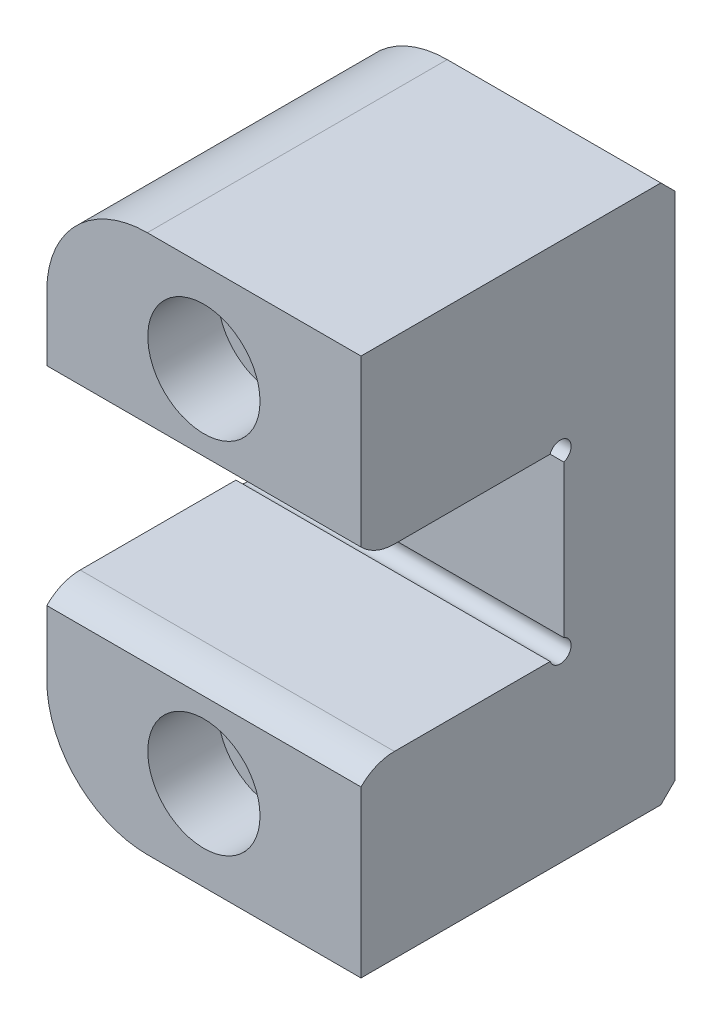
ISO-10303-21;
HEADER;
FILE_DESCRIPTION(('STEP AP214'),'2;1');
FILE_NAME('part.step','',(''),(''),'','','');
FILE_SCHEMA(('AUTOMOTIVE_DESIGN { 1 0 10303 214 1 1 1 1 }'));
ENDSEC;
DATA;
#1=APPLICATION_CONTEXT('core data for automotive mechanical design processes');
#2=APPLICATION_PROTOCOL_DEFINITION('international standard','automotive_design',2000,#1);
#3=PRODUCT_CONTEXT('',#1,'mechanical');
#4=PRODUCT('Part','Part','',(#3));
#5=PRODUCT_RELATED_PRODUCT_CATEGORY('part','',(#4));
#6=PRODUCT_DEFINITION_FORMATION('','',#4);
#7=PRODUCT_DEFINITION_CONTEXT('part definition',#1,'design');
#8=PRODUCT_DEFINITION('design','',#6,#7);
#9=PRODUCT_DEFINITION_SHAPE('','',#8);
#10=(LENGTH_UNIT() NAMED_UNIT(*) SI_UNIT(.MILLI.,.METRE.));
#11=(NAMED_UNIT(*) PLANE_ANGLE_UNIT() SI_UNIT($,.RADIAN.));
#12=(NAMED_UNIT(*) SI_UNIT($,.STERADIAN.) SOLID_ANGLE_UNIT());
#13=UNCERTAINTY_MEASURE_WITH_UNIT(LENGTH_MEASURE(1.E-05),#10,'distance_accuracy_value','');
#14=(GEOMETRIC_REPRESENTATION_CONTEXT(3) GLOBAL_UNCERTAINTY_ASSIGNED_CONTEXT((#13)) GLOBAL_UNIT_ASSIGNED_CONTEXT((#10,
#11,#12)) REPRESENTATION_CONTEXT('',''));
#15=CARTESIAN_POINT('',(0.,0.,0.));
#16=DIRECTION('',(0.,0.,1.));
#17=DIRECTION('',(1.,0.,0.));
#18=AXIS2_PLACEMENT_3D('',#15,#16,#17);
#19=CARTESIAN_POINT('',(11.1125,6.35,-14.351));
#20=DIRECTION('',(0.,0.,-1.));
#21=DIRECTION('',(-1.,0.,0.));
#22=AXIS2_PLACEMENT_3D('',#19,#20,#21);
#23=PLANE('',#22);
#24=DIRECTION('',(-0.866025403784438,0.500000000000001,0.));
#25=VECTOR('',#24,1.);
#26=CARTESIAN_POINT('',(4.86884233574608,-4.46433229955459,-14.351));
#27=LINE('',#26,#25);
#28=CARTESIAN_POINT('',(-8.50411357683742,3.25654739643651,-14.351));
#29=VERTEX_POINT('',#28);
#30=CARTESIAN_POINT('',(-11.1125,4.7625,-14.351));
#31=VERTEX_POINT('',#30);
#32=EDGE_CURVE('E340',#29,#31,#27,.T.);
#33=ORIENTED_EDGE('',*,*,#32,.F.);
#34=DIRECTION('',(0.,-1.,0.));
#35=VECTOR('',#34,1.);
#36=CARTESIAN_POINT('',(-8.50411357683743,-3.84595644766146,-14.351));
#37=LINE('',#36,#35);
#38=CARTESIAN_POINT('',(-8.50411357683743,-3.25654739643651,-14.351));
#39=VERTEX_POINT('',#38);
#40=EDGE_CURVE('E255',#29,#39,#37,.T.);
#41=ORIENTED_EDGE('',*,*,#40,.T.);
#42=DIRECTION('',(0.866025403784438,0.500000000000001,0.));
#43=VECTOR('',#42,1.);
#44=CARTESIAN_POINT('',(10.3681036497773,7.63933229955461,-14.351));
#45=LINE('',#44,#43);
#46=CARTESIAN_POINT('',(-11.1125,-4.76249999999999,-14.351));
#47=VERTEX_POINT('',#46);
#48=EDGE_CURVE('E338',#47,#39,#45,.T.);
#49=ORIENTED_EDGE('',*,*,#48,.F.);
#50=DIRECTION('',(0.,-1.,0.));
#51=VECTOR('',#50,1.);
#52=CARTESIAN_POINT('',(-11.1125,6.35,-14.351));
#53=LINE('',#52,#51);
#54=CARTESIAN_POINT('',(-11.1125,-5.37757951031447,-14.351));
#55=VERTEX_POINT('',#54);
#56=EDGE_CURVE('E221',#47,#55,#53,.T.);
#57=ORIENTED_EDGE('',*,*,#56,.T.);
#58=DIRECTION('',(1.,0.,0.));
#59=VECTOR('',#58,1.);
#60=CARTESIAN_POINT('',(-11.1125,-5.37757951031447,-14.351));
#61=LINE('',#60,#59);
#62=CARTESIAN_POINT('',(11.1125,-5.37757951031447,-14.351));
#63=VERTEX_POINT('',#62);
#64=EDGE_CURVE('E194',#55,#63,#61,.T.);
#65=ORIENTED_EDGE('',*,*,#64,.T.);
#66=DIRECTION('',(0.,-1.,0.));
#67=VECTOR('',#66,1.);
#68=CARTESIAN_POINT('',(11.1125,6.35,-14.351));
#69=LINE('',#68,#67);
#70=CARTESIAN_POINT('',(11.1125,5.37757951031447,-14.351));
#71=VERTEX_POINT('',#70);
#72=EDGE_CURVE('E348',#71,#63,#69,.T.);
#73=ORIENTED_EDGE('',*,*,#72,.F.);
#74=DIRECTION('',(1.,0.,0.));
#75=VECTOR('',#74,1.);
#76=CARTESIAN_POINT('',(-11.1125,5.37757951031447,-14.351));
#77=LINE('',#76,#75);
#78=CARTESIAN_POINT('',(-11.1125,5.37757951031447,-14.351));
#79=VERTEX_POINT('',#78);
#80=EDGE_CURVE('E416',#71,#79,#77,.F.);
#81=ORIENTED_EDGE('',*,*,#80,.T.);
#82=EDGE_CURVE('E215',#79,#31,#53,.T.);
#83=ORIENTED_EDGE('',*,*,#82,.T.);
#84=EDGE_LOOP('',(#33,#41,#49,#57,#65,#73,#81,#83));
#85=FACE_BOUND('',#84,.T.);
#86=ADVANCED_FACE('F32',(#85),#23,.F.);
#87=CARTESIAN_POINT('',(11.1125,19.05,-22.225));
#88=DIRECTION('',(0.,0.,1.));
#89=DIRECTION('',(1.,0.,0.));
#90=AXIS2_PLACEMENT_3D('',#87,#88,#89);
#91=PLANE('',#90);
#92=CARTESIAN_POINT('',(0.,12.7,-22.225));
#93=DIRECTION('',(0.,0.,1.));
#94=DIRECTION('',(1.,0.,0.));
#95=AXIS2_PLACEMENT_3D('',#92,#93,#94);
#96=CIRCLE('',#95,2.45744999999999);
#97=CARTESIAN_POINT('',(2.45744999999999,12.7,-22.225));
#98=VERTEX_POINT('',#97);
#99=EDGE_CURVE('E720',#98,#98,#96,.T.);
#100=ORIENTED_EDGE('',*,*,#99,.T.);
#101=EDGE_LOOP('',(#100));
#102=FACE_BOUND('',#101,.T.);
#103=CARTESIAN_POINT('',(0.,-12.7,-22.225));
#104=DIRECTION('',(0.,0.,1.));
#105=DIRECTION('',(1.,0.,0.));
#106=AXIS2_PLACEMENT_3D('',#103,#104,#105);
#107=CIRCLE('',#106,2.45744999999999);
#108=CARTESIAN_POINT('',(2.45744999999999,-12.7,-22.225));
#109=VERTEX_POINT('',#108);
#110=EDGE_CURVE('E706',#109,#109,#107,.T.);
#111=ORIENTED_EDGE('',*,*,#110,.T.);
#112=EDGE_LOOP('',(#111));
#113=FACE_BOUND('',#112,.T.);
#114=CARTESIAN_POINT('',(-4.0005,-11.938,-22.225));
#115=DIRECTION('',(0.,0.,1.));
#116=DIRECTION('',(1.,0.,0.));
#117=AXIS2_PLACEMENT_3D('',#114,#115,#116);
#118=CIRCLE('',#117,6.09600000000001);
#119=CARTESIAN_POINT('',(-4.0005,-18.034,-22.225));
#120=VERTEX_POINT('',#119);
#121=CARTESIAN_POINT('',(-10.0965,-11.938,-22.225));
#122=VERTEX_POINT('',#121);
#123=EDGE_CURVE('E271',#120,#122,#118,.F.);
#124=ORIENTED_EDGE('',*,*,#123,.T.);
#125=DIRECTION('',(0.,1.,0.));
#126=VECTOR('',#125,1.);
#127=CARTESIAN_POINT('',(-10.0965,-4.76249999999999,-22.225));
#128=LINE('',#127,#126);
#129=CARTESIAN_POINT('',(-10.0965,-4.17591212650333,-22.225));
#130=VERTEX_POINT('',#129);
#131=EDGE_CURVE('E273',#122,#130,#128,.T.);
#132=ORIENTED_EDGE('',*,*,#131,.T.);
#133=DIRECTION('',(0.866025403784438,0.500000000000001,0.));
#134=VECTOR('',#133,1.);
#135=CARTESIAN_POINT('',(-9.525,-3.84595644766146,-22.225));
#136=LINE('',#135,#134);
#137=CARTESIAN_POINT('',(-9.525,-3.84595644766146,-22.225));
#138=VERTEX_POINT('',#137);
#139=EDGE_CURVE('E324',#130,#138,#136,.T.);
#140=ORIENTED_EDGE('',*,*,#139,.T.);
#141=DIRECTION('',(0.,1.,0.));
#142=VECTOR('',#141,1.);
#143=CARTESIAN_POINT('',(-9.525,3.84595644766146,-22.225));
#144=LINE('',#143,#142);
#145=CARTESIAN_POINT('',(-9.525,3.84595644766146,-22.225));
#146=VERTEX_POINT('',#145);
#147=EDGE_CURVE('E323',#138,#146,#144,.T.);
#148=ORIENTED_EDGE('',*,*,#147,.T.);
#149=DIRECTION('',(-0.866025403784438,0.500000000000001,0.));
#150=VECTOR('',#149,1.);
#151=CARTESIAN_POINT('',(-9.525,3.84595644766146,-22.225));
#152=LINE('',#151,#150);
#153=CARTESIAN_POINT('',(-10.0965,4.17591212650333,-22.225));
#154=VERTEX_POINT('',#153);
#155=EDGE_CURVE('E317',#146,#154,#152,.T.);
#156=ORIENTED_EDGE('',*,*,#155,.T.);
#157=DIRECTION('',(0.,1.,0.));
#158=VECTOR('',#157,1.);
#159=CARTESIAN_POINT('',(-10.0965,11.938,-22.225));
#160=LINE('',#159,#158);
#161=CARTESIAN_POINT('',(-10.0965,11.938,-22.225));
#162=VERTEX_POINT('',#161);
#163=EDGE_CURVE('E265',#154,#162,#160,.T.);
#164=ORIENTED_EDGE('',*,*,#163,.T.);
#165=CARTESIAN_POINT('',(-4.0005,11.938,-22.225));
#166=DIRECTION('',(0.,0.,1.));
#167=DIRECTION('',(1.,0.,0.));
#168=AXIS2_PLACEMENT_3D('',#165,#166,#167);
#169=CIRCLE('',#168,6.09599999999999);
#170=CARTESIAN_POINT('',(-4.0005,18.034,-22.225));
#171=VERTEX_POINT('',#170);
#172=EDGE_CURVE('E263',#162,#171,#169,.F.);
#173=ORIENTED_EDGE('',*,*,#172,.T.);
#174=DIRECTION('',(1.,0.,0.));
#175=VECTOR('',#174,1.);
#176=CARTESIAN_POINT('',(11.1125,18.034,-22.225));
#177=LINE('',#176,#175);
#178=CARTESIAN_POINT('',(11.1125,18.034,-22.225));
#179=VERTEX_POINT('',#178);
#180=EDGE_CURVE('E267',#171,#179,#177,.T.);
#181=ORIENTED_EDGE('',*,*,#180,.T.);
#182=DIRECTION('',(0.,1.,0.));
#183=VECTOR('',#182,1.);
#184=CARTESIAN_POINT('',(11.1125,19.05,-22.225));
#185=LINE('',#184,#183);
#186=CARTESIAN_POINT('',(11.1125,-18.034,-22.225));
#187=VERTEX_POINT('',#186);
#188=EDGE_CURVE('E357',#187,#179,#185,.T.);
#189=ORIENTED_EDGE('',*,*,#188,.F.);
#190=DIRECTION('',(-1.,0.,0.));
#191=VECTOR('',#190,1.);
#192=CARTESIAN_POINT('',(11.1125,-18.034,-22.225));
#193=LINE('',#192,#191);
#194=EDGE_CURVE('E269',#187,#120,#193,.T.);
#195=ORIENTED_EDGE('',*,*,#194,.T.);
#196=EDGE_LOOP('',(#124,#132,#140,#148,#156,#164,#173,#181,#189,#195));
#197=FACE_BOUND('',#196,.T.);
#198=ADVANCED_FACE('F321',(#102,#113,#197),#91,.F.);
#199=CARTESIAN_POINT('',(-11.1125,-6.35,0.));
#200=DIRECTION('',(-1.,0.,0.));
#201=DIRECTION('',(0.,0.,1.));
#202=AXIS2_PLACEMENT_3D('',#199,#200,#201);
#203=PLANE('',#202);
#204=DIRECTION('',(0.,0.,1.));
#205=VECTOR('',#204,1.);
#206=CARTESIAN_POINT('',(-11.1125,11.938,-22.225));
#207=LINE('',#206,#205);
#208=CARTESIAN_POINT('',(-11.1125,11.938,0.));
#209=VERTEX_POINT('',#208);
#210=CARTESIAN_POINT('',(-11.1125,11.938,-21.209));
#211=VERTEX_POINT('',#210);
#212=EDGE_CURVE('E235',#209,#211,#207,.F.);
#213=ORIENTED_EDGE('',*,*,#212,.T.);
#214=DIRECTION('',(0.,-1.,0.));
#215=VECTOR('',#214,1.);
#216=CARTESIAN_POINT('',(-11.1125,4.7625,-21.209));
#217=LINE('',#216,#215);
#218=CARTESIAN_POINT('',(-11.1125,4.76249999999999,-21.209));
#219=VERTEX_POINT('',#218);
#220=EDGE_CURVE('E49',#211,#219,#217,.T.);
#221=ORIENTED_EDGE('',*,*,#220,.T.);
#222=DIRECTION('',(0.,0.,1.));
#223=VECTOR('',#222,1.);
#224=CARTESIAN_POINT('',(-11.1125,4.7625,0.));
#225=LINE('',#224,#223);
#226=EDGE_CURVE('E247',#219,#31,#225,.T.);
#227=ORIENTED_EDGE('',*,*,#226,.T.);
#228=ORIENTED_EDGE('',*,*,#82,.F.);
#229=CARTESIAN_POINT('',(-11.1125,6.096,-14.097));
#230=DIRECTION('',(1.,0.,0.));
#231=DIRECTION('',(0.,0.,-1.));
#232=AXIS2_PLACEMENT_3D('',#229,#230,#231);
#233=CIRCLE('',#232,0.762000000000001);
#234=CARTESIAN_POINT('',(-11.1125,6.35,-13.3785795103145));
#235=VERTEX_POINT('',#234);
#236=EDGE_CURVE('E423',#79,#235,#233,.T.);
#237=ORIENTED_EDGE('',*,*,#236,.T.);
#238=DIRECTION('',(0.,0.,-1.));
#239=VECTOR('',#238,1.);
#240=CARTESIAN_POINT('',(-11.1125,6.35,0.));
#241=LINE('',#240,#239);
#242=CARTESIAN_POINT('',(-11.1125,6.35,-2.36219999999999));
#243=VERTEX_POINT('',#242);
#244=EDGE_CURVE('E362',#243,#235,#241,.T.);
#245=ORIENTED_EDGE('',*,*,#244,.F.);
#246=CARTESIAN_POINT('',(-11.1125,9.64915342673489,-2.36219999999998));
#247=DIRECTION('',(-1.,0.,0.));
#248=DIRECTION('',(0.,0.,-1.));
#249=AXIS2_PLACEMENT_3D('',#246,#247,#248);
#250=CIRCLE('',#249,3.29915342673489);
#251=CARTESIAN_POINT('',(-11.1125,7.3460198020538,0.));
#252=VERTEX_POINT('',#251);
#253=EDGE_CURVE('E415',#243,#252,#250,.T.);
#254=ORIENTED_EDGE('',*,*,#253,.T.);
#255=DIRECTION('',(0.,-1.,0.));
#256=VECTOR('',#255,1.);
#257=CARTESIAN_POINT('',(-11.1125,19.05,0.));
#258=LINE('',#257,#256);
#259=EDGE_CURVE('E342',#209,#252,#258,.T.);
#260=ORIENTED_EDGE('',*,*,#259,.F.);
#261=EDGE_LOOP('',(#213,#221,#227,#228,#237,#245,#254,#260));
#262=FACE_BOUND('',#261,.T.);
#263=ADVANCED_FACE('F459',(#262),#203,.T.);
#264=DIRECTION('',(0.,0.,-1.));
#265=VECTOR('',#264,1.);
#266=CARTESIAN_POINT('',(-11.1125,-4.76249999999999,0.));
#267=LINE('',#266,#265);
#268=CARTESIAN_POINT('',(-11.1125,-4.76249999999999,-21.209));
#269=VERTEX_POINT('',#268);
#270=EDGE_CURVE('E245',#47,#269,#267,.T.);
#271=ORIENTED_EDGE('',*,*,#270,.T.);
#272=DIRECTION('',(0.,-1.,0.));
#273=VECTOR('',#272,1.);
#274=CARTESIAN_POINT('',(-11.1125,-11.938,-21.209));
#275=LINE('',#274,#273);
#276=CARTESIAN_POINT('',(-11.1125,-11.938,-21.209));
#277=VERTEX_POINT('',#276);
#278=EDGE_CURVE('E278',#269,#277,#275,.T.);
#279=ORIENTED_EDGE('',*,*,#278,.T.);
#280=DIRECTION('',(0.,0.,-1.));
#281=VECTOR('',#280,1.);
#282=CARTESIAN_POINT('',(-11.1125,-11.938,0.));
#283=LINE('',#282,#281);
#284=CARTESIAN_POINT('',(-11.1125,-11.938,0.));
#285=VERTEX_POINT('',#284);
#286=EDGE_CURVE('E237',#277,#285,#283,.F.);
#287=ORIENTED_EDGE('',*,*,#286,.T.);
#288=DIRECTION('',(0.,-1.,0.));
#289=VECTOR('',#288,1.);
#290=CARTESIAN_POINT('',(-11.1125,-6.35,0.));
#291=LINE('',#290,#289);
#292=CARTESIAN_POINT('',(-11.1125,-7.3460198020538,0.));
#293=VERTEX_POINT('',#292);
#294=EDGE_CURVE('E214',#293,#285,#291,.T.);
#295=ORIENTED_EDGE('',*,*,#294,.F.);
#296=CARTESIAN_POINT('',(-11.1125,-9.64915342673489,-2.36219999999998));
#297=DIRECTION('',(-1.,0.,0.));
#298=DIRECTION('',(0.,0.,1.));
#299=AXIS2_PLACEMENT_3D('',#296,#297,#298);
#300=CIRCLE('',#299,3.29915342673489);
#301=CARTESIAN_POINT('',(-11.1125,-6.35,-2.36219999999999));
#302=VERTEX_POINT('',#301);
#303=EDGE_CURVE('E213',#293,#302,#300,.T.);
#304=ORIENTED_EDGE('',*,*,#303,.T.);
#305=DIRECTION('',(0.,0.,1.));
#306=VECTOR('',#305,1.);
#307=CARTESIAN_POINT('',(-11.1125,-6.35,-14.351));
#308=LINE('',#307,#306);
#309=CARTESIAN_POINT('',(-11.1125,-6.35,-13.3785795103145));
#310=VERTEX_POINT('',#309);
#311=EDGE_CURVE('E205',#310,#302,#308,.T.);
#312=ORIENTED_EDGE('',*,*,#311,.F.);
#313=CARTESIAN_POINT('',(-11.1125,-6.096,-14.097));
#314=DIRECTION('',(1.,0.,0.));
#315=DIRECTION('',(0.,0.,1.));
#316=AXIS2_PLACEMENT_3D('',#313,#314,#315);
#317=CIRCLE('',#316,0.762000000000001);
#318=EDGE_CURVE('E188',#310,#55,#317,.T.);
#319=ORIENTED_EDGE('',*,*,#318,.T.);
#320=ORIENTED_EDGE('',*,*,#56,.F.);
#321=EDGE_LOOP('',(#271,#279,#287,#295,#304,#312,#319,#320));
#322=FACE_BOUND('',#321,.T.);
#323=ADVANCED_FACE('F211',(#322),#203,.T.);
#324=CARTESIAN_POINT('',(11.1125,19.05,0.));
#325=DIRECTION('',(0.,0.,-1.));
#326=DIRECTION('',(0.,1.,0.));
#327=AXIS2_PLACEMENT_3D('',#324,#325,#326);
#328=PLANE('',#327);
#329=CARTESIAN_POINT('',(0.,12.7,0.));
#330=DIRECTION('',(0.,0.,1.));
#331=DIRECTION('',(1.,0.,0.));
#332=AXIS2_PLACEMENT_3D('',#329,#330,#331);
#333=CIRCLE('',#332,3.96875);
#334=CARTESIAN_POINT('',(3.96875,12.7,0.));
#335=VERTEX_POINT('',#334);
#336=EDGE_CURVE('E298',#335,#335,#333,.T.);
#337=ORIENTED_EDGE('',*,*,#336,.F.);
#338=EDGE_LOOP('',(#337));
#339=FACE_BOUND('',#338,.T.);
#340=ORIENTED_EDGE('',*,*,#259,.T.);
#341=DIRECTION('',(1.,0.,0.));
#342=VECTOR('',#341,1.);
#343=CARTESIAN_POINT('',(-11.1125,7.3460198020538,0.));
#344=LINE('',#343,#342);
#345=CARTESIAN_POINT('',(11.1125,7.3460198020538,0.));
#346=VERTEX_POINT('',#345);
#347=EDGE_CURVE('E410',#252,#346,#344,.T.);
#348=ORIENTED_EDGE('',*,*,#347,.T.);
#349=DIRECTION('',(0.,-1.,0.));
#350=VECTOR('',#349,1.);
#351=CARTESIAN_POINT('',(11.1125,19.05,0.));
#352=LINE('',#351,#350);
#353=CARTESIAN_POINT('',(11.1125,19.05,0.));
#354=VERTEX_POINT('',#353);
#355=EDGE_CURVE('E218',#354,#346,#352,.T.);
#356=ORIENTED_EDGE('',*,*,#355,.F.);
#357=DIRECTION('',(-1.,0.,0.));
#358=VECTOR('',#357,1.);
#359=CARTESIAN_POINT('',(11.1125,19.05,0.));
#360=LINE('',#359,#358);
#361=CARTESIAN_POINT('',(-4.0005,19.05,0.));
#362=VERTEX_POINT('',#361);
#363=EDGE_CURVE('E225',#354,#362,#360,.T.);
#364=ORIENTED_EDGE('',*,*,#363,.T.);
#365=CARTESIAN_POINT('',(-4.0005,11.938,0.));
#366=DIRECTION('',(0.,0.,-1.));
#367=DIRECTION('',(0.,1.,0.));
#368=AXIS2_PLACEMENT_3D('',#365,#366,#367);
#369=CIRCLE('',#368,7.112);
#370=EDGE_CURVE('E243',#362,#209,#369,.F.);
#371=ORIENTED_EDGE('',*,*,#370,.T.);
#372=EDGE_LOOP('',(#340,#348,#356,#364,#371));
#373=FACE_BOUND('',#372,.T.);
#374=ADVANCED_FACE('F409',(#339,#373),#328,.F.);
#375=CARTESIAN_POINT('',(11.1125,6.35,0.));
#376=DIRECTION('',(0.,1.,0.));
#377=DIRECTION('',(0.,0.,1.));
#378=AXIS2_PLACEMENT_3D('',#375,#376,#377);
#379=PLANE('',#378);
#380=ORIENTED_EDGE('',*,*,#244,.T.);
#381=DIRECTION('',(1.,0.,0.));
#382=VECTOR('',#381,1.);
#383=CARTESIAN_POINT('',(-11.1125,6.35,-13.3785795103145));
#384=LINE('',#383,#382);
#385=CARTESIAN_POINT('',(11.1125,6.35,-13.3785795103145));
#386=VERTEX_POINT('',#385);
#387=EDGE_CURVE('E420',#235,#386,#384,.T.);
#388=ORIENTED_EDGE('',*,*,#387,.T.);
#389=DIRECTION('',(0.,0.,-1.));
#390=VECTOR('',#389,1.);
#391=CARTESIAN_POINT('',(11.1125,6.35,0.));
#392=LINE('',#391,#390);
#393=CARTESIAN_POINT('',(11.1125,6.35,-2.36219999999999));
#394=VERTEX_POINT('',#393);
#395=EDGE_CURVE('E345',#394,#386,#392,.T.);
#396=ORIENTED_EDGE('',*,*,#395,.F.);
#397=DIRECTION('',(1.,0.,0.));
#398=VECTOR('',#397,1.);
#399=CARTESIAN_POINT('',(-11.1125,6.35,-2.36219999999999));
#400=LINE('',#399,#398);
#401=EDGE_CURVE('E419',#243,#394,#400,.T.);
#402=ORIENTED_EDGE('',*,*,#401,.F.);
#403=EDGE_LOOP('',(#380,#388,#396,#402));
#404=FACE_BOUND('',#403,.T.);
#405=ADVANCED_FACE('F418',(#404),#379,.F.);
#406=CARTESIAN_POINT('',(11.1125,-6.35,-14.351));
#407=DIRECTION('',(0.,-1.,0.));
#408=DIRECTION('',(0.,0.,-1.));
#409=AXIS2_PLACEMENT_3D('',#406,#407,#408);
#410=PLANE('',#409);
#411=DIRECTION('',(0.,0.,1.));
#412=VECTOR('',#411,1.);
#413=CARTESIAN_POINT('',(11.1125,-6.35,-14.351));
#414=LINE('',#413,#412);
#415=CARTESIAN_POINT('',(11.1125,-6.35,-13.3785795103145));
#416=VERTEX_POINT('',#415);
#417=CARTESIAN_POINT('',(11.1125,-6.35,-2.36219999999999));
#418=VERTEX_POINT('',#417);
#419=EDGE_CURVE('E207',#416,#418,#414,.T.);
#420=ORIENTED_EDGE('',*,*,#419,.F.);
#421=DIRECTION('',(1.,0.,0.));
#422=VECTOR('',#421,1.);
#423=CARTESIAN_POINT('',(-11.1125,-6.35,-13.3785795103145));
#424=LINE('',#423,#422);
#425=EDGE_CURVE('E191',#416,#310,#424,.F.);
#426=ORIENTED_EDGE('',*,*,#425,.T.);
#427=ORIENTED_EDGE('',*,*,#311,.T.);
#428=DIRECTION('',(1.,0.,0.));
#429=VECTOR('',#428,1.);
#430=CARTESIAN_POINT('',(-11.1125,-6.35,-2.36219999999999));
#431=LINE('',#430,#429);
#432=EDGE_CURVE('E328',#302,#418,#431,.T.);
#433=ORIENTED_EDGE('',*,*,#432,.T.);
#434=EDGE_LOOP('',(#420,#426,#427,#433));
#435=FACE_BOUND('',#434,.T.);
#436=ADVANCED_FACE('F203',(#435),#410,.F.);
#437=CARTESIAN_POINT('',(11.1125,-6.35,0.));
#438=DIRECTION('',(0.,0.,-1.));
#439=DIRECTION('',(0.,1.,0.));
#440=AXIS2_PLACEMENT_3D('',#437,#438,#439);
#441=PLANE('',#440);
#442=CARTESIAN_POINT('',(0.,-12.7,0.));
#443=DIRECTION('',(0.,0.,1.));
#444=DIRECTION('',(1.,0.,0.));
#445=AXIS2_PLACEMENT_3D('',#442,#443,#444);
#446=CIRCLE('',#445,3.96875);
#447=CARTESIAN_POINT('',(3.96875,-12.7,0.));
#448=VERTEX_POINT('',#447);
#449=EDGE_CURVE('E717',#448,#448,#446,.T.);
#450=ORIENTED_EDGE('',*,*,#449,.F.);
#451=EDGE_LOOP('',(#450));
#452=FACE_BOUND('',#451,.T.);
#453=DIRECTION('',(0.,-1.,0.));
#454=VECTOR('',#453,1.);
#455=CARTESIAN_POINT('',(11.1125,-6.35,0.));
#456=LINE('',#455,#454);
#457=CARTESIAN_POINT('',(11.1125,-7.3460198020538,0.));
#458=VERTEX_POINT('',#457);
#459=CARTESIAN_POINT('',(11.1125,-19.05,0.));
#460=VERTEX_POINT('',#459);
#461=EDGE_CURVE('E352',#458,#460,#456,.T.);
#462=ORIENTED_EDGE('',*,*,#461,.F.);
#463=DIRECTION('',(1.,0.,0.));
#464=VECTOR('',#463,1.);
#465=CARTESIAN_POINT('',(-11.1125,-7.3460198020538,0.));
#466=LINE('',#465,#464);
#467=EDGE_CURVE('E325',#293,#458,#466,.T.);
#468=ORIENTED_EDGE('',*,*,#467,.F.);
#469=ORIENTED_EDGE('',*,*,#294,.T.);
#470=CARTESIAN_POINT('',(-4.0005,-11.938,0.));
#471=DIRECTION('',(0.,0.,-1.));
#472=DIRECTION('',(0.,1.,0.));
#473=AXIS2_PLACEMENT_3D('',#470,#471,#472);
#474=CIRCLE('',#473,7.112);
#475=CARTESIAN_POINT('',(-4.0005,-19.05,0.));
#476=VERTEX_POINT('',#475);
#477=EDGE_CURVE('E239',#285,#476,#474,.F.);
#478=ORIENTED_EDGE('',*,*,#477,.T.);
#479=DIRECTION('',(-1.,0.,0.));
#480=VECTOR('',#479,1.);
#481=CARTESIAN_POINT('',(11.1125,-19.05,0.));
#482=LINE('',#481,#480);
#483=EDGE_CURVE('E228',#460,#476,#482,.T.);
#484=ORIENTED_EDGE('',*,*,#483,.F.);
#485=EDGE_LOOP('',(#462,#468,#469,#478,#484));
#486=FACE_BOUND('',#485,.T.);
#487=ADVANCED_FACE('F443',(#452,#486),#441,.F.);
#488=CARTESIAN_POINT('',(11.1125,-19.05,0.));
#489=DIRECTION('',(0.,1.,0.));
#490=DIRECTION('',(0.,0.,1.));
#491=AXIS2_PLACEMENT_3D('',#488,#489,#490);
#492=PLANE('',#491);
#493=DIRECTION('',(0.,0.,-1.));
#494=VECTOR('',#493,1.);
#495=CARTESIAN_POINT('',(-4.0005,-19.05,-22.225));
#496=LINE('',#495,#494);
#497=CARTESIAN_POINT('',(-4.0005,-19.05,-21.209));
#498=VERTEX_POINT('',#497);
#499=EDGE_CURVE('E232',#476,#498,#496,.T.);
#500=ORIENTED_EDGE('',*,*,#499,.T.);
#501=DIRECTION('',(1.,0.,0.));
#502=VECTOR('',#501,1.);
#503=CARTESIAN_POINT('',(11.1125,-19.05,-21.209));
#504=LINE('',#503,#502);
#505=CARTESIAN_POINT('',(11.1125,-19.05,-21.209));
#506=VERTEX_POINT('',#505);
#507=EDGE_CURVE('E282',#498,#506,#504,.T.);
#508=ORIENTED_EDGE('',*,*,#507,.T.);
#509=DIRECTION('',(0.,0.,-1.));
#510=VECTOR('',#509,1.);
#511=CARTESIAN_POINT('',(11.1125,-19.05,0.));
#512=LINE('',#511,#510);
#513=EDGE_CURVE('E354',#460,#506,#512,.T.);
#514=ORIENTED_EDGE('',*,*,#513,.F.);
#515=ORIENTED_EDGE('',*,*,#483,.T.);
#516=EDGE_LOOP('',(#500,#508,#514,#515));
#517=FACE_BOUND('',#516,.T.);
#518=ADVANCED_FACE('F389',(#517),#492,.F.);
#519=CARTESIAN_POINT('',(11.1125,19.05,0.));
#520=DIRECTION('',(0.,-1.,0.));
#521=DIRECTION('',(0.,0.,-1.));
#522=AXIS2_PLACEMENT_3D('',#519,#520,#521);
#523=PLANE('',#522);
#524=DIRECTION('',(0.,0.,1.));
#525=VECTOR('',#524,1.);
#526=CARTESIAN_POINT('',(11.1125,19.05,0.));
#527=LINE('',#526,#525);
#528=CARTESIAN_POINT('',(11.1125,19.05,-21.209));
#529=VERTEX_POINT('',#528);
#530=EDGE_CURVE('E229',#529,#354,#527,.T.);
#531=ORIENTED_EDGE('',*,*,#530,.F.);
#532=DIRECTION('',(-1.,0.,0.));
#533=VECTOR('',#532,1.);
#534=CARTESIAN_POINT('',(11.1125,19.05,-21.209));
#535=LINE('',#534,#533);
#536=CARTESIAN_POINT('',(-4.0005,19.05,-21.209));
#537=VERTEX_POINT('',#536);
#538=EDGE_CURVE('E288',#529,#537,#535,.T.);
#539=ORIENTED_EDGE('',*,*,#538,.T.);
#540=DIRECTION('',(0.,0.,1.));
#541=VECTOR('',#540,1.);
#542=CARTESIAN_POINT('',(-4.0005,19.05,0.));
#543=LINE('',#542,#541);
#544=EDGE_CURVE('E241',#537,#362,#543,.T.);
#545=ORIENTED_EDGE('',*,*,#544,.T.);
#546=ORIENTED_EDGE('',*,*,#363,.F.);
#547=EDGE_LOOP('',(#531,#539,#545,#546));
#548=FACE_BOUND('',#547,.T.);
#549=ADVANCED_FACE('F404',(#548),#523,.F.);
#550=CARTESIAN_POINT('',(11.1125,-6.35,0.));
#551=DIRECTION('',(-1.,0.,0.));
#552=DIRECTION('',(0.,0.,1.));
#553=AXIS2_PLACEMENT_3D('',#550,#551,#552);
#554=PLANE('',#553);
#555=ORIENTED_EDGE('',*,*,#513,.T.);
#556=DIRECTION('',(0.,-0.707106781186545,0.70710678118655));
#557=VECTOR('',#556,1.);
#558=CARTESIAN_POINT('',(11.1125,-18.034,-22.225));
#559=LINE('',#558,#557);
#560=EDGE_CURVE('E286',#506,#187,#559,.F.);
#561=ORIENTED_EDGE('',*,*,#560,.T.);
#562=ORIENTED_EDGE('',*,*,#188,.T.);
#563=DIRECTION('',(0.,-0.707106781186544,-0.707106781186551));
#564=VECTOR('',#563,1.);
#565=CARTESIAN_POINT('',(11.1125,19.05,-21.209));
#566=LINE('',#565,#564);
#567=EDGE_CURVE('E284',#179,#529,#566,.F.);
#568=ORIENTED_EDGE('',*,*,#567,.T.);
#569=ORIENTED_EDGE('',*,*,#530,.T.);
#570=ORIENTED_EDGE('',*,*,#355,.T.);
#571=CARTESIAN_POINT('',(11.1125,9.64915342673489,-2.36219999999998));
#572=DIRECTION('',(-1.,0.,0.));
#573=DIRECTION('',(0.,0.,-1.));
#574=AXIS2_PLACEMENT_3D('',#571,#572,#573);
#575=CIRCLE('',#574,3.29915342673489);
#576=EDGE_CURVE('E412',#394,#346,#575,.T.);
#577=ORIENTED_EDGE('',*,*,#576,.F.);
#578=ORIENTED_EDGE('',*,*,#395,.T.);
#579=CARTESIAN_POINT('',(11.1125,6.096,-14.097));
#580=DIRECTION('',(-1.,0.,0.));
#581=DIRECTION('',(0.,0.,1.));
#582=AXIS2_PLACEMENT_3D('',#579,#580,#581);
#583=CIRCLE('',#582,0.762000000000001);
#584=EDGE_CURVE('E249',#386,#71,#583,.T.);
#585=ORIENTED_EDGE('',*,*,#584,.T.);
#586=ORIENTED_EDGE('',*,*,#72,.T.);
#587=CARTESIAN_POINT('',(11.1125,-6.096,-14.097));
#588=DIRECTION('',(1.,0.,0.));
#589=DIRECTION('',(0.,0.,1.));
#590=AXIS2_PLACEMENT_3D('',#587,#588,#589);
#591=CIRCLE('',#590,0.762000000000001);
#592=EDGE_CURVE('E199',#416,#63,#591,.T.);
#593=ORIENTED_EDGE('',*,*,#592,.F.);
#594=ORIENTED_EDGE('',*,*,#419,.T.);
#595=CARTESIAN_POINT('',(11.1125,-9.64915342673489,-2.36219999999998));
#596=DIRECTION('',(-1.,0.,0.));
#597=DIRECTION('',(0.,0.,1.));
#598=AXIS2_PLACEMENT_3D('',#595,#596,#597);
#599=CIRCLE('',#598,3.29915342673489);
#600=EDGE_CURVE('E433',#458,#418,#599,.T.);
#601=ORIENTED_EDGE('',*,*,#600,.F.);
#602=ORIENTED_EDGE('',*,*,#461,.T.);
#603=EDGE_LOOP('',(#555,#561,#562,#568,#569,#570,#577,#578,#585,#586,#593,#594,#601,#602));
#604=FACE_BOUND('',#603,.T.);
#605=ADVANCED_FACE('F398',(#604),#554,.F.);
#606=CARTESIAN_POINT('',(-4.0005,-11.938,0.));
#607=DIRECTION('',(0.,0.,1.));
#608=DIRECTION('',(1.,0.,0.));
#609=AXIS2_PLACEMENT_3D('',#606,#607,#608);
#610=CYLINDRICAL_SURFACE('',#609,7.112);
#611=ORIENTED_EDGE('',*,*,#286,.F.);
#612=CARTESIAN_POINT('',(-4.0005,-11.938,-21.209));
#613=DIRECTION('',(0.,0.,1.));
#614=DIRECTION('',(1.,0.,0.));
#615=AXIS2_PLACEMENT_3D('',#612,#613,#614);
#616=CIRCLE('',#615,7.112);
#617=EDGE_CURVE('E280',#277,#498,#616,.T.);
#618=ORIENTED_EDGE('',*,*,#617,.T.);
#619=ORIENTED_EDGE('',*,*,#499,.F.);
#620=ORIENTED_EDGE('',*,*,#477,.F.);
#621=EDGE_LOOP('',(#611,#618,#619,#620));
#622=FACE_BOUND('',#621,.T.);
#623=ADVANCED_FACE('F385',(#622),#610,.T.);
#624=CARTESIAN_POINT('',(-4.0005,11.938,0.));
#625=DIRECTION('',(0.,0.,-1.));
#626=DIRECTION('',(-1.,0.,0.));
#627=AXIS2_PLACEMENT_3D('',#624,#625,#626);
#628=CYLINDRICAL_SURFACE('',#627,7.112);
#629=ORIENTED_EDGE('',*,*,#544,.F.);
#630=CARTESIAN_POINT('',(-4.0005,11.938,-21.209));
#631=DIRECTION('',(0.,0.,1.));
#632=DIRECTION('',(1.,0.,0.));
#633=AXIS2_PLACEMENT_3D('',#630,#631,#632);
#634=CIRCLE('',#633,7.112);
#635=EDGE_CURVE('E11',#537,#211,#634,.T.);
#636=ORIENTED_EDGE('',*,*,#635,.T.);
#637=ORIENTED_EDGE('',*,*,#212,.F.);
#638=ORIENTED_EDGE('',*,*,#370,.F.);
#639=EDGE_LOOP('',(#629,#636,#637,#638));
#640=FACE_BOUND('',#639,.T.);
#641=ADVANCED_FACE('F470',(#640),#628,.T.);
#642=CARTESIAN_POINT('',(-9.525,3.84595644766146,0.));
#643=DIRECTION('',(-1.,0.,0.));
#644=DIRECTION('',(0.,-1.,0.));
#645=AXIS2_PLACEMENT_3D('',#642,#643,#644);
#646=PLANE('',#645);
#647=DIRECTION('',(0.,0.,-1.));
#648=VECTOR('',#647,1.);
#649=CARTESIAN_POINT('',(-9.525,-3.84595644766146,0.));
#650=LINE('',#649,#648);
#651=CARTESIAN_POINT('',(-9.525,-3.84595644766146,-18.161));
#652=VERTEX_POINT('',#651);
#653=EDGE_CURVE('E335',#652,#138,#650,.T.);
#654=ORIENTED_EDGE('',*,*,#653,.F.);
#655=DIRECTION('',(0.,1.,0.));
#656=VECTOR('',#655,1.);
#657=CARTESIAN_POINT('',(-9.525,3.84595644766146,-18.161));
#658=LINE('',#657,#656);
#659=CARTESIAN_POINT('',(-9.525,3.84595644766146,-18.161));
#660=VERTEX_POINT('',#659);
#661=EDGE_CURVE('E252',#652,#660,#658,.T.);
#662=ORIENTED_EDGE('',*,*,#661,.T.);
#663=DIRECTION('',(0.,0.,-1.));
#664=VECTOR('',#663,1.);
#665=CARTESIAN_POINT('',(-9.525,3.84595644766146,0.));
#666=LINE('',#665,#664);
#667=EDGE_CURVE('E333',#660,#146,#666,.T.);
#668=ORIENTED_EDGE('',*,*,#667,.T.);
#669=ORIENTED_EDGE('',*,*,#147,.F.);
#670=EDGE_LOOP('',(#654,#662,#668,#669));
#671=FACE_BOUND('',#670,.T.);
#672=ADVANCED_FACE('F473',(#671),#646,.T.);
#673=CARTESIAN_POINT('',(-9.525,3.84595644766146,0.));
#674=DIRECTION('',(-0.500000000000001,-0.866025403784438,0.));
#675=DIRECTION('',(0.866025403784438,-0.500000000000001,0.));
#676=AXIS2_PLACEMENT_3D('',#673,#674,#675);
#677=PLANE('',#676);
#678=ORIENTED_EDGE('',*,*,#226,.F.);
#679=DIRECTION('',(0.654653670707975,-0.377964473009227,-0.654653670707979));
#680=VECTOR('',#679,1.);
#681=CARTESIAN_POINT('',(-19.2949285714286,9.48662733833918,-13.0265714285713));
#682=LINE('',#681,#680);
#683=EDGE_CURVE('E41',#219,#154,#682,.T.);
#684=ORIENTED_EDGE('',*,*,#683,.T.);
#685=ORIENTED_EDGE('',*,*,#155,.F.);
#686=ORIENTED_EDGE('',*,*,#667,.F.);
#687=DIRECTION('',(0.25597695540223,-0.147788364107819,0.955319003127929));
#688=VECTOR('',#687,1.);
#689=CARTESIAN_POINT('',(-9.525,3.84595644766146,-18.161));
#690=LINE('',#689,#688);
#691=EDGE_CURVE('E258',#660,#29,#690,.T.);
#692=ORIENTED_EDGE('',*,*,#691,.T.);
#693=ORIENTED_EDGE('',*,*,#32,.T.);
#694=EDGE_LOOP('',(#678,#684,#685,#686,#692,#693));
#695=FACE_BOUND('',#694,.T.);
#696=ADVANCED_FACE('F315',(#695),#677,.T.);
#697=CARTESIAN_POINT('',(-9.525,-3.84595644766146,0.));
#698=DIRECTION('',(-0.500000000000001,0.866025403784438,0.));
#699=DIRECTION('',(-0.866025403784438,-0.500000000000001,0.));
#700=AXIS2_PLACEMENT_3D('',#697,#698,#699);
#701=PLANE('',#700);
#702=ORIENTED_EDGE('',*,*,#139,.F.);
#703=DIRECTION('',(-0.654653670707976,-0.377964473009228,0.654653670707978));
#704=VECTOR('',#703,1.);
#705=CARTESIAN_POINT('',(-19.2949285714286,-9.48662733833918,-13.0265714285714));
#706=LINE('',#705,#704);
#707=EDGE_CURVE('E276',#130,#269,#706,.T.);
#708=ORIENTED_EDGE('',*,*,#707,.T.);
#709=ORIENTED_EDGE('',*,*,#270,.F.);
#710=ORIENTED_EDGE('',*,*,#48,.T.);
#711=DIRECTION('',(-0.25597695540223,-0.147788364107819,-0.955319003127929));
#712=VECTOR('',#711,1.);
#713=CARTESIAN_POINT('',(-9.23401173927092,-3.67795429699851,-17.075017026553));
#714=LINE('',#713,#712);
#715=EDGE_CURVE('E261',#39,#652,#714,.T.);
#716=ORIENTED_EDGE('',*,*,#715,.T.);
#717=ORIENTED_EDGE('',*,*,#653,.T.);
#718=EDGE_LOOP('',(#702,#708,#709,#710,#716,#717));
#719=FACE_BOUND('',#718,.T.);
#720=ADVANCED_FACE('F587',(#719),#701,.T.);
#721=CARTESIAN_POINT('',(-11.1125,-9.64915342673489,-2.36219999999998));
#722=DIRECTION('',(1.,0.,0.));
#723=DIRECTION('',(0.,0.,-1.));
#724=AXIS2_PLACEMENT_3D('',#721,#722,#723);
#725=CYLINDRICAL_SURFACE('',#724,3.29915342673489);
#726=ORIENTED_EDGE('',*,*,#600,.T.);
#727=ORIENTED_EDGE('',*,*,#432,.F.);
#728=ORIENTED_EDGE('',*,*,#303,.F.);
#729=ORIENTED_EDGE('',*,*,#467,.T.);
#730=EDGE_LOOP('',(#726,#727,#728,#729));
#731=FACE_BOUND('',#730,.T.);
#732=ADVANCED_FACE('F439',(#731),#725,.T.);
#733=CARTESIAN_POINT('',(-11.1125,9.64915342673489,-2.36219999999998));
#734=DIRECTION('',(1.,0.,0.));
#735=DIRECTION('',(0.,0.,-1.));
#736=AXIS2_PLACEMENT_3D('',#733,#734,#735);
#737=CYLINDRICAL_SURFACE('',#736,3.29915342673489);
#738=ORIENTED_EDGE('',*,*,#576,.T.);
#739=ORIENTED_EDGE('',*,*,#347,.F.);
#740=ORIENTED_EDGE('',*,*,#253,.F.);
#741=ORIENTED_EDGE('',*,*,#401,.T.);
#742=EDGE_LOOP('',(#738,#739,#740,#741));
#743=FACE_BOUND('',#742,.T.);
#744=ADVANCED_FACE('F572',(#743),#737,.T.);
#745=CARTESIAN_POINT('',(-11.1125,6.096,-14.097));
#746=DIRECTION('',(1.,0.,0.));
#747=DIRECTION('',(0.,0.,-1.));
#748=AXIS2_PLACEMENT_3D('',#745,#746,#747);
#749=CYLINDRICAL_SURFACE('',#748,0.762000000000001);
#750=ORIENTED_EDGE('',*,*,#584,.F.);
#751=ORIENTED_EDGE('',*,*,#387,.F.);
#752=ORIENTED_EDGE('',*,*,#236,.F.);
#753=ORIENTED_EDGE('',*,*,#80,.F.);
#754=EDGE_LOOP('',(#750,#751,#752,#753));
#755=FACE_BOUND('',#754,.T.);
#756=ADVANCED_FACE('F564',(#755),#749,.F.);
#757=CARTESIAN_POINT('',(-11.1125,-6.096,-14.097));
#758=DIRECTION('',(1.,0.,0.));
#759=DIRECTION('',(0.,0.,-1.));
#760=AXIS2_PLACEMENT_3D('',#757,#758,#759);
#761=CYLINDRICAL_SURFACE('',#760,0.762000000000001);
#762=ORIENTED_EDGE('',*,*,#318,.F.);
#763=ORIENTED_EDGE('',*,*,#425,.F.);
#764=ORIENTED_EDGE('',*,*,#592,.T.);
#765=ORIENTED_EDGE('',*,*,#64,.F.);
#766=EDGE_LOOP('',(#762,#763,#764,#765));
#767=FACE_BOUND('',#766,.T.);
#768=ADVANCED_FACE('F190',(#767),#761,.F.);
#769=CARTESIAN_POINT('',(0.,-12.7,0.));
#770=DIRECTION('',(0.,0.,1.));
#771=DIRECTION('',(1.,0.,0.));
#772=AXIS2_PLACEMENT_3D('',#769,#770,#771);
#773=CYLINDRICAL_SURFACE('',#772,2.45745);
#774=ORIENTED_EDGE('',*,*,#110,.F.);
#775=EDGE_LOOP('',(#774));
#776=FACE_BOUND('',#775,.T.);
#777=CARTESIAN_POINT('',(0.,-12.7,-4.96062));
#778=DIRECTION('',(0.,0.,1.));
#779=DIRECTION('',(1.,0.,0.));
#780=AXIS2_PLACEMENT_3D('',#777,#778,#779);
#781=CIRCLE('',#780,2.45745);
#782=CARTESIAN_POINT('',(2.45745,-12.7,-4.96062));
#783=VERTEX_POINT('',#782);
#784=EDGE_CURVE('E709',#783,#783,#781,.T.);
#785=ORIENTED_EDGE('',*,*,#784,.T.);
#786=EDGE_LOOP('',(#785));
#787=FACE_BOUND('',#786,.T.);
#788=ADVANCED_FACE('F549',(#776,#787),#773,.F.);
#789=CARTESIAN_POINT('',(2.45745,-12.7,-4.96062));
#790=DIRECTION('',(0.,0.,-1.));
#791=DIRECTION('',(-1.,0.,0.));
#792=AXIS2_PLACEMENT_3D('',#789,#790,#791);
#793=PLANE('',#792);
#794=ORIENTED_EDGE('',*,*,#784,.F.);
#795=EDGE_LOOP('',(#794));
#796=FACE_BOUND('',#795,.T.);
#797=CARTESIAN_POINT('',(0.,-12.7,-4.96062));
#798=DIRECTION('',(0.,0.,1.));
#799=DIRECTION('',(1.,0.,0.));
#800=AXIS2_PLACEMENT_3D('',#797,#798,#799);
#801=CIRCLE('',#800,3.96875);
#802=CARTESIAN_POINT('',(3.96875,-12.7,-4.96062));
#803=VERTEX_POINT('',#802);
#804=EDGE_CURVE('E714',#803,#803,#801,.T.);
#805=ORIENTED_EDGE('',*,*,#804,.T.);
#806=EDGE_LOOP('',(#805));
#807=FACE_BOUND('',#806,.T.);
#808=ADVANCED_FACE('F541',(#796,#807),#793,.F.);
#809=CARTESIAN_POINT('',(0.,-12.7,0.));
#810=DIRECTION('',(0.,0.,1.));
#811=DIRECTION('',(1.,0.,0.));
#812=AXIS2_PLACEMENT_3D('',#809,#810,#811);
#813=CYLINDRICAL_SURFACE('',#812,3.96875);
#814=ORIENTED_EDGE('',*,*,#804,.F.);
#815=EDGE_LOOP('',(#814));
#816=FACE_BOUND('',#815,.T.);
#817=ORIENTED_EDGE('',*,*,#449,.T.);
#818=EDGE_LOOP('',(#817));
#819=FACE_BOUND('',#818,.T.);
#820=ADVANCED_FACE('F533',(#816,#819),#813,.F.);
#821=CARTESIAN_POINT('',(0.,12.7,0.));
#822=DIRECTION('',(0.,0.,1.));
#823=DIRECTION('',(1.,0.,0.));
#824=AXIS2_PLACEMENT_3D('',#821,#822,#823);
#825=CYLINDRICAL_SURFACE('',#824,2.45745);
#826=ORIENTED_EDGE('',*,*,#99,.F.);
#827=EDGE_LOOP('',(#826));
#828=FACE_BOUND('',#827,.T.);
#829=CARTESIAN_POINT('',(0.,12.7,-4.96062));
#830=DIRECTION('',(0.,0.,1.));
#831=DIRECTION('',(1.,0.,0.));
#832=AXIS2_PLACEMENT_3D('',#829,#830,#831);
#833=CIRCLE('',#832,2.45745);
#834=CARTESIAN_POINT('',(2.45745,12.7,-4.96062));
#835=VERTEX_POINT('',#834);
#836=EDGE_CURVE('E723',#835,#835,#833,.T.);
#837=ORIENTED_EDGE('',*,*,#836,.T.);
#838=EDGE_LOOP('',(#837));
#839=FACE_BOUND('',#838,.T.);
#840=ADVANCED_FACE('F525',(#828,#839),#825,.F.);
#841=CARTESIAN_POINT('',(2.45745,12.7,-4.96062));
#842=DIRECTION('',(0.,0.,-1.));
#843=DIRECTION('',(-1.,0.,0.));
#844=AXIS2_PLACEMENT_3D('',#841,#842,#843);
#845=PLANE('',#844);
#846=ORIENTED_EDGE('',*,*,#836,.F.);
#847=EDGE_LOOP('',(#846));
#848=FACE_BOUND('',#847,.T.);
#849=CARTESIAN_POINT('',(0.,12.7,-4.96062));
#850=DIRECTION('',(0.,0.,1.));
#851=DIRECTION('',(1.,0.,0.));
#852=AXIS2_PLACEMENT_3D('',#849,#850,#851);
#853=CIRCLE('',#852,3.96875);
#854=CARTESIAN_POINT('',(3.96875,12.7,-4.96062));
#855=VERTEX_POINT('',#854);
#856=EDGE_CURVE('E726',#855,#855,#853,.T.);
#857=ORIENTED_EDGE('',*,*,#856,.T.);
#858=EDGE_LOOP('',(#857));
#859=FACE_BOUND('',#858,.T.);
#860=ADVANCED_FACE('F517',(#848,#859),#845,.F.);
#861=CARTESIAN_POINT('',(0.,12.7,0.));
#862=DIRECTION('',(0.,0.,1.));
#863=DIRECTION('',(1.,0.,0.));
#864=AXIS2_PLACEMENT_3D('',#861,#862,#863);
#865=CYLINDRICAL_SURFACE('',#864,3.96875);
#866=ORIENTED_EDGE('',*,*,#856,.F.);
#867=EDGE_LOOP('',(#866));
#868=FACE_BOUND('',#867,.T.);
#869=ORIENTED_EDGE('',*,*,#336,.T.);
#870=EDGE_LOOP('',(#869));
#871=FACE_BOUND('',#870,.T.);
#872=ADVANCED_FACE('F477',(#868,#871),#865,.F.);
#873=CARTESIAN_POINT('',(-9.525,3.84595644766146,-18.161));
#874=DIRECTION('',(-0.965925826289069,0.,0.258819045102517));
#875=DIRECTION('',(0.258819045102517,0.,0.965925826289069));
#876=AXIS2_PLACEMENT_3D('',#873,#874,#875);
#877=PLANE('',#876);
#878=ORIENTED_EDGE('',*,*,#715,.F.);
#879=ORIENTED_EDGE('',*,*,#40,.F.);
#880=ORIENTED_EDGE('',*,*,#691,.F.);
#881=ORIENTED_EDGE('',*,*,#661,.F.);
#882=EDGE_LOOP('',(#878,#879,#880,#881));
#883=FACE_BOUND('',#882,.T.);
#884=ADVANCED_FACE('F474',(#883),#877,.T.);
#885=CARTESIAN_POINT('',(11.1125,-18.034,-22.225));
#886=DIRECTION('',(0.,0.70710678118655,0.707106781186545));
#887=DIRECTION('',(0.,-0.707106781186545,0.70710678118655));
#888=AXIS2_PLACEMENT_3D('',#885,#886,#887);
#889=PLANE('',#888);
#890=ORIENTED_EDGE('',*,*,#560,.F.);
#891=ORIENTED_EDGE('',*,*,#507,.F.);
#892=DIRECTION('',(0.,-0.707106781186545,0.70710678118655));
#893=VECTOR('',#892,1.);
#894=CARTESIAN_POINT('',(-4.0005,-18.034,-22.225));
#895=LINE('',#894,#893);
#896=EDGE_CURVE('E296',#120,#498,#895,.T.);
#897=ORIENTED_EDGE('',*,*,#896,.F.);
#898=ORIENTED_EDGE('',*,*,#194,.F.);
#899=EDGE_LOOP('',(#890,#891,#897,#898));
#900=FACE_BOUND('',#899,.T.);
#901=ADVANCED_FACE('F394',(#900),#889,.F.);
#902=CARTESIAN_POINT('',(-4.0005,-11.938,-22.225));
#903=DIRECTION('',(0.,0.,1.));
#904=DIRECTION('',(1.,0.,0.));
#905=AXIS2_PLACEMENT_3D('',#902,#903,#904);
#906=CONICAL_SURFACE('',#905,6.09600000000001,0.785398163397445);
#907=ORIENTED_EDGE('',*,*,#896,.T.);
#908=ORIENTED_EDGE('',*,*,#617,.F.);
#909=DIRECTION('',(-0.707106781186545,0.,0.70710678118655));
#910=VECTOR('',#909,1.);
#911=CARTESIAN_POINT('',(-10.0965,-11.938,-22.225));
#912=LINE('',#911,#910);
#913=EDGE_CURVE('E293',#122,#277,#912,.T.);
#914=ORIENTED_EDGE('',*,*,#913,.F.);
#915=ORIENTED_EDGE('',*,*,#123,.F.);
#916=EDGE_LOOP('',(#907,#908,#914,#915));
#917=FACE_BOUND('',#916,.T.);
#918=ADVANCED_FACE('F381',(#917),#906,.T.);
#919=CARTESIAN_POINT('',(-10.0965,19.05,-22.225));
#920=DIRECTION('',(-0.707106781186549,0.,-0.707106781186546));
#921=DIRECTION('',(-0.707106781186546,0.,0.707106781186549));
#922=AXIS2_PLACEMENT_3D('',#919,#920,#921);
#923=PLANE('',#922);
#924=ORIENTED_EDGE('',*,*,#913,.T.);
#925=ORIENTED_EDGE('',*,*,#278,.F.);
#926=ORIENTED_EDGE('',*,*,#707,.F.);
#927=ORIENTED_EDGE('',*,*,#131,.F.);
#928=EDGE_LOOP('',(#924,#925,#926,#927));
#929=FACE_BOUND('',#928,.T.);
#930=ADVANCED_FACE('F375',(#929),#923,.T.);
#931=CARTESIAN_POINT('',(-10.0965,19.05,-22.225));
#932=DIRECTION('',(-0.70710678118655,0.,-0.707106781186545));
#933=DIRECTION('',(-0.707106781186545,0.,0.70710678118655));
#934=AXIS2_PLACEMENT_3D('',#931,#932,#933);
#935=PLANE('',#934);
#936=ORIENTED_EDGE('',*,*,#683,.F.);
#937=ORIENTED_EDGE('',*,*,#220,.F.);
#938=DIRECTION('',(-0.707106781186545,0.,0.70710678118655));
#939=VECTOR('',#938,1.);
#940=CARTESIAN_POINT('',(-10.0965,11.938,-22.225));
#941=LINE('',#940,#939);
#942=EDGE_CURVE('E36',#162,#211,#941,.T.);
#943=ORIENTED_EDGE('',*,*,#942,.F.);
#944=ORIENTED_EDGE('',*,*,#163,.F.);
#945=EDGE_LOOP('',(#936,#937,#943,#944));
#946=FACE_BOUND('',#945,.T.);
#947=ADVANCED_FACE('F34',(#946),#935,.T.);
#948=CARTESIAN_POINT('',(-4.0005,11.938,-22.225));
#949=DIRECTION('',(0.,0.,1.));
#950=DIRECTION('',(1.,0.,0.));
#951=AXIS2_PLACEMENT_3D('',#948,#949,#950);
#952=CONICAL_SURFACE('',#951,6.09599999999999,0.785398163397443);
#953=ORIENTED_EDGE('',*,*,#942,.T.);
#954=ORIENTED_EDGE('',*,*,#635,.F.);
#955=DIRECTION('',(0.,0.707106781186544,0.707106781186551));
#956=VECTOR('',#955,1.);
#957=CARTESIAN_POINT('',(-4.0005,18.034,-22.225));
#958=LINE('',#957,#956);
#959=EDGE_CURVE('E299',#171,#537,#958,.T.);
#960=ORIENTED_EDGE('',*,*,#959,.F.);
#961=ORIENTED_EDGE('',*,*,#172,.F.);
#962=EDGE_LOOP('',(#953,#954,#960,#961));
#963=FACE_BOUND('',#962,.T.);
#964=ADVANCED_FACE('F308',(#963),#952,.T.);
#965=CARTESIAN_POINT('',(11.1125,19.05,-21.209));
#966=DIRECTION('',(0.,-0.707106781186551,0.707106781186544));
#967=DIRECTION('',(0.,-0.707106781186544,-0.707106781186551));
#968=AXIS2_PLACEMENT_3D('',#965,#966,#967);
#969=PLANE('',#968);
#970=ORIENTED_EDGE('',*,*,#567,.F.);
#971=ORIENTED_EDGE('',*,*,#180,.F.);
#972=ORIENTED_EDGE('',*,*,#959,.T.);
#973=ORIENTED_EDGE('',*,*,#538,.F.);
#974=EDGE_LOOP('',(#970,#971,#972,#973));
#975=FACE_BOUND('',#974,.T.);
#976=ADVANCED_FACE('F400',(#975),#969,.F.);
#977=CLOSED_SHELL('',(#86,#198,#263,#323,#374,#405,#436,#487,#518,#549,#605,#623,#641,#672,#696,
#720,#732,#744,#756,#768,#788,#808,#820,#840,#860,#872,#884,#901,#918,#930,#947,#964,#976));
#978=MANIFOLD_SOLID_BREP('B2',#977);
#979=ADVANCED_BREP_SHAPE_REPRESENTATION('',(#18,#978),#14);
#980=SHAPE_DEFINITION_REPRESENTATION(#9,#979);
ENDSEC;
END-ISO-10303-21;
